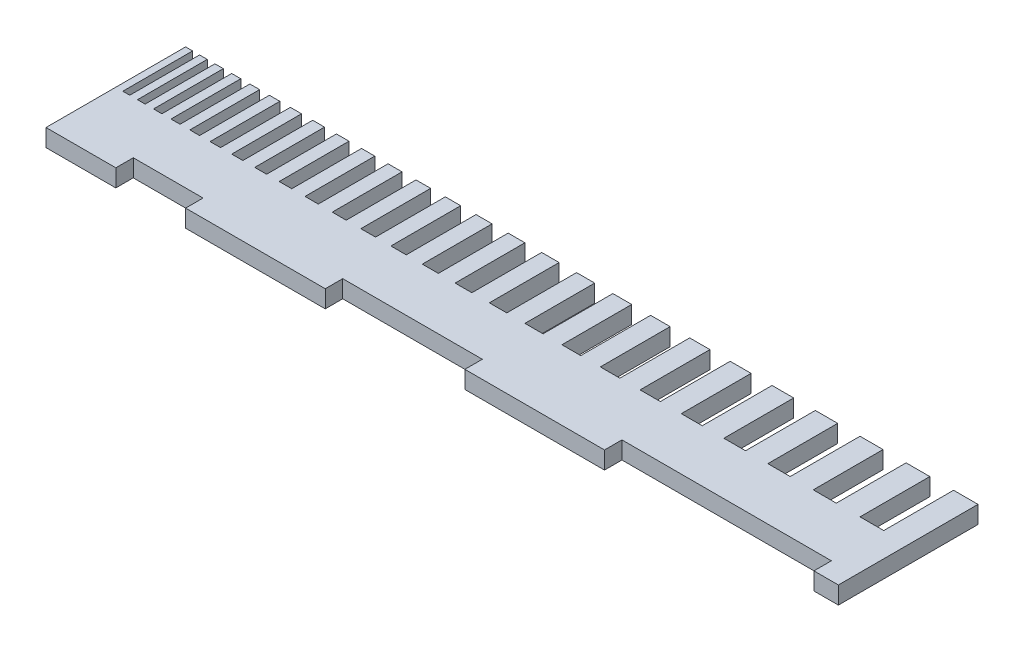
from build123d import *

# Parameters (mm, degrees)
BOSS_EXTRUDE1_DEPTH = 6.35


with BuildPart() as part:
    # Sketch1 → Boss-Extrude1 (new body)
    with BuildSketch(Plane(origin=(0, 0, 0), x_dir=(1, 0, 0), z_dir=(0, 1, 0))):
        Polygon((2.54, 50.8), (2.54, 25.4), (5.08, 25.4), (5.08, 50.8), (7.874, 50.8), (7.874, 25.4), (10.668, 25.4), (10.668, 50.8), (13.716, 50.8), (13.716, 25.4), (16.764, 25.4), (16.764, 50.8), (20.066, 50.8), (20.066, 25.4), (23.368, 25.4), (23.368, 50.8), (26.924, 50.8), (26.924, 25.4), (30.48, 25.4), (30.48, 50.8), (34.29, 50.8), (34.29, 25.4), (38.1, 25.4), (38.1, 50.8), (42.164, 50.8), (42.164, 25.4), (46.228, 25.4), (46.228, 50.8), (50.546, 50.8), (50.546, 25.4), (54.864, 25.4), (54.864, 50.8), (59.436, 50.8), (59.436, 25.4), (64.008, 25.4), (64.008, 50.8), (68.834, 50.8), (68.834, 25.4), (73.66, 25.4), (73.66, 50.8), (78.74, 50.8), (78.74, 25.4), (83.82, 25.4), (83.82, 50.8), (89.154, 50.8), (89.154, 25.4), (94.488, 25.4), (94.488, 50.8), (100.076, 50.8), (100.076, 25.4), (105.664, 25.4), (105.664, 50.8), (111.506, 50.8), (111.506, 25.4), (117.348, 25.4), (117.348, 50.8), (123.444, 50.8), (123.444, 25.4), (129.54, 25.4), (129.54, 50.8), (135.89, 50.8), (135.89, 25.4), (142.24, 25.4), (142.24, 50.8), (148.844, 50.8), (148.844, 25.4), (155.448, 25.4), (155.448, 50.8), (162.306, 50.8), (162.306, 25.4), (169.164, 25.4), (169.164, 50.8), (176.276, 50.8), (176.276, 25.4), (183.388, 25.4), (183.388, 50.8), (190.754, 50.8), (190.754, 25.4), (198.12, 25.4), (198.12, 50.8), (205.74, 50.8), (205.74, 25.4), (213.36, 25.4), (213.36, 50.8), (221.234, 50.8), (221.234, 25.4), (229.108, 25.4), (229.108, 50.8), (237.236, 50.8), (237.236, 25.4), (245.364, 25.4), (245.364, 50.8), (253.746, 50.8), (253.746, 25.4), (262.128, 25.4), (262.128, 50.8), (270.764, 50.8), (270.764, 25.4), (279.4, 25.4), (279.4, 50.8), (288.29, 50.8), (288.29, 20.284578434), (288.29, 0), (279.4, 0), (279.4, 6.35), (203.2, 6.35), (203.2, 0), (152.4, 0), (152.4, 6.35), (101.6, 6.35), (101.6, 0), (50.8, 0), (50.8, 6.35), (25.4, 6.35), (25.4, 0), (0, 0), (0, 50.8), align=None)
    extrude(amount=BOSS_EXTRUDE1_DEPTH)


solid = part.part
